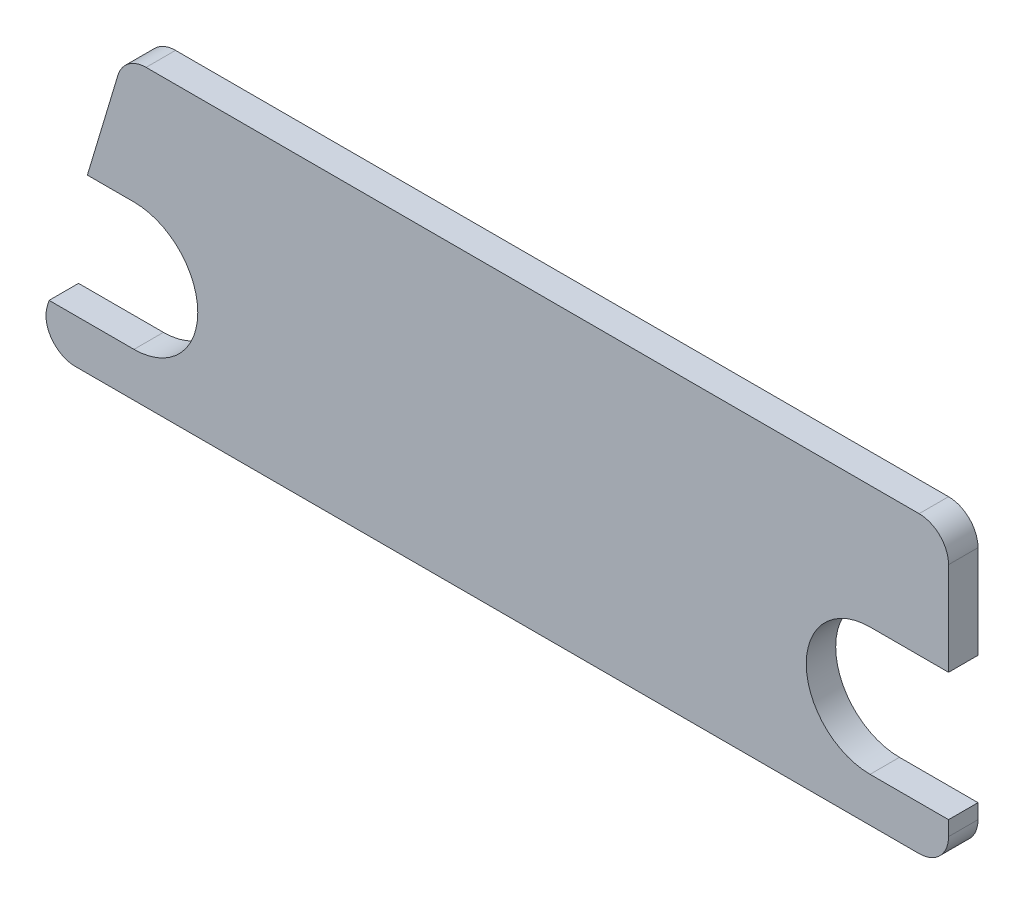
ISO-10303-21;
HEADER;
FILE_DESCRIPTION(('STEP AP214'),'2;1');
FILE_NAME('part.step','',(''),(''),'','','');
FILE_SCHEMA(('AUTOMOTIVE_DESIGN { 1 0 10303 214 1 1 1 1 }'));
ENDSEC;
DATA;
#1=APPLICATION_CONTEXT('core data for automotive mechanical design processes');
#2=APPLICATION_PROTOCOL_DEFINITION('international standard','automotive_design',2000,#1);
#3=PRODUCT_CONTEXT('',#1,'mechanical');
#4=PRODUCT('Part','Part','',(#3));
#5=PRODUCT_RELATED_PRODUCT_CATEGORY('part','',(#4));
#6=PRODUCT_DEFINITION_FORMATION('','',#4);
#7=PRODUCT_DEFINITION_CONTEXT('part definition',#1,'design');
#8=PRODUCT_DEFINITION('design','',#6,#7);
#9=PRODUCT_DEFINITION_SHAPE('','',#8);
#10=(LENGTH_UNIT() NAMED_UNIT(*) SI_UNIT(.MILLI.,.METRE.));
#11=(NAMED_UNIT(*) PLANE_ANGLE_UNIT() SI_UNIT($,.RADIAN.));
#12=(NAMED_UNIT(*) SI_UNIT($,.STERADIAN.) SOLID_ANGLE_UNIT());
#13=UNCERTAINTY_MEASURE_WITH_UNIT(LENGTH_MEASURE(1.E-05),#10,'distance_accuracy_value','');
#14=(GEOMETRIC_REPRESENTATION_CONTEXT(3) GLOBAL_UNCERTAINTY_ASSIGNED_CONTEXT((#13)) GLOBAL_UNIT_ASSIGNED_CONTEXT((#10,
#11,#12)) REPRESENTATION_CONTEXT('',''));
#15=CARTESIAN_POINT('',(0.,0.,0.));
#16=DIRECTION('',(0.,0.,1.));
#17=DIRECTION('',(1.,0.,0.));
#18=AXIS2_PLACEMENT_3D('',#15,#16,#17);
#19=CARTESIAN_POINT('',(-88.9679080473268,2.99999999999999,3.));
#20=DIRECTION('',(0.,0.,-1.));
#21=DIRECTION('',(-1.,0.,0.));
#22=AXIS2_PLACEMENT_3D('',#19,#20,#21);
#23=CYLINDRICAL_SURFACE('',#22,3.00000000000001);
#24=CARTESIAN_POINT('',(-88.9679080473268,2.99999999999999,0.));
#25=DIRECTION('',(0.,0.,1.));
#26=DIRECTION('',(-1.,0.,0.));
#27=AXIS2_PLACEMENT_3D('',#24,#25,#26);
#28=CIRCLE('',#27,3.00000000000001);
#29=CARTESIAN_POINT('',(-91.8413869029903,3.86204365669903,0.));
#30=VERTEX_POINT('',#29);
#31=CARTESIAN_POINT('',(-88.9679080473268,0.,0.));
#32=VERTEX_POINT('',#31);
#33=EDGE_CURVE('E146',#30,#32,#28,.T.);
#34=ORIENTED_EDGE('',*,*,#33,.T.);
#35=DIRECTION('',(0.,0.,-1.));
#36=VECTOR('',#35,1.);
#37=CARTESIAN_POINT('',(-88.9679080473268,0.,3.));
#38=LINE('',#37,#36);
#39=CARTESIAN_POINT('',(-88.9679080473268,0.,3.));
#40=VERTEX_POINT('',#39);
#41=EDGE_CURVE('E11',#40,#32,#38,.T.);
#42=ORIENTED_EDGE('',*,*,#41,.F.);
#43=CARTESIAN_POINT('',(-88.9679080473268,2.99999999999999,3.));
#44=DIRECTION('',(0.,0.,1.));
#45=DIRECTION('',(-1.,0.,0.));
#46=AXIS2_PLACEMENT_3D('',#43,#44,#45);
#47=CIRCLE('',#46,3.00000000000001);
#48=CARTESIAN_POINT('',(-91.8413869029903,3.86204365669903,3.));
#49=VERTEX_POINT('',#48);
#50=EDGE_CURVE('E189',#49,#40,#47,.T.);
#51=ORIENTED_EDGE('',*,*,#50,.F.);
#52=DIRECTION('',(0.,0.,-1.));
#53=VECTOR('',#52,1.);
#54=CARTESIAN_POINT('',(-91.8413869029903,3.86204365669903,3.));
#55=LINE('',#54,#53);
#56=EDGE_CURVE('E159',#49,#30,#55,.T.);
#57=ORIENTED_EDGE('',*,*,#56,.T.);
#58=EDGE_LOOP('',(#34,#42,#51,#57));
#59=FACE_BOUND('',#58,.T.);
#60=ADVANCED_FACE('F30',(#59),#23,.T.);
#61=CARTESIAN_POINT('',(-3.00000000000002,0.,3.));
#62=DIRECTION('',(0.,1.,0.));
#63=DIRECTION('',(-1.,0.,0.));
#64=AXIS2_PLACEMENT_3D('',#61,#62,#63);
#65=PLANE('',#64);
#66=DIRECTION('',(1.,0.,0.));
#67=VECTOR('',#66,1.);
#68=CARTESIAN_POINT('',(-3.00000000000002,0.,0.));
#69=LINE('',#68,#67);
#70=CARTESIAN_POINT('',(-3.00000000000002,0.,0.));
#71=VERTEX_POINT('',#70);
#72=EDGE_CURVE('E142',#32,#71,#69,.T.);
#73=ORIENTED_EDGE('',*,*,#72,.T.);
#74=DIRECTION('',(0.,0.,-1.));
#75=VECTOR('',#74,1.);
#76=CARTESIAN_POINT('',(-3.00000000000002,0.,3.));
#77=LINE('',#76,#75);
#78=CARTESIAN_POINT('',(-3.00000000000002,0.,3.));
#79=VERTEX_POINT('',#78);
#80=EDGE_CURVE('E37',#79,#71,#77,.T.);
#81=ORIENTED_EDGE('',*,*,#80,.F.);
#82=DIRECTION('',(1.,0.,0.));
#83=VECTOR('',#82,1.);
#84=CARTESIAN_POINT('',(-3.00000000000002,0.,3.));
#85=LINE('',#84,#83);
#86=EDGE_CURVE('E155',#40,#79,#85,.T.);
#87=ORIENTED_EDGE('',*,*,#86,.F.);
#88=ORIENTED_EDGE('',*,*,#41,.T.);
#89=EDGE_LOOP('',(#73,#81,#87,#88));
#90=FACE_BOUND('',#89,.T.);
#91=ADVANCED_FACE('F154',(#90),#65,.F.);
#92=CARTESIAN_POINT('',(-3.,3.,3.));
#93=DIRECTION('',(0.,0.,-1.));
#94=DIRECTION('',(-1.,0.,0.));
#95=AXIS2_PLACEMENT_3D('',#92,#93,#94);
#96=CYLINDRICAL_SURFACE('',#95,3.);
#97=CARTESIAN_POINT('',(-3.,3.,0.));
#98=DIRECTION('',(0.,0.,1.));
#99=DIRECTION('',(-1.,0.,0.));
#100=AXIS2_PLACEMENT_3D('',#97,#98,#99);
#101=CIRCLE('',#100,3.);
#102=CARTESIAN_POINT('',(0.,3.00000000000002,0.));
#103=VERTEX_POINT('',#102);
#104=EDGE_CURVE('E148',#71,#103,#101,.T.);
#105=ORIENTED_EDGE('',*,*,#104,.T.);
#106=DIRECTION('',(0.,0.,-1.));
#107=VECTOR('',#106,1.);
#108=CARTESIAN_POINT('',(0.,3.00000000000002,3.));
#109=LINE('',#108,#107);
#110=CARTESIAN_POINT('',(0.,3.00000000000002,3.));
#111=VERTEX_POINT('',#110);
#112=EDGE_CURVE('E255',#111,#103,#109,.T.);
#113=ORIENTED_EDGE('',*,*,#112,.F.);
#114=CARTESIAN_POINT('',(-3.,3.,3.));
#115=DIRECTION('',(0.,0.,1.));
#116=DIRECTION('',(-1.,0.,0.));
#117=AXIS2_PLACEMENT_3D('',#114,#115,#116);
#118=CIRCLE('',#117,3.);
#119=EDGE_CURVE('E192',#79,#111,#118,.T.);
#120=ORIENTED_EDGE('',*,*,#119,.F.);
#121=ORIENTED_EDGE('',*,*,#80,.T.);
#122=EDGE_LOOP('',(#105,#113,#120,#121));
#123=FACE_BOUND('',#122,.T.);
#124=ADVANCED_FACE('F259',(#123),#96,.T.);
#125=CARTESIAN_POINT('',(0.,3.00000000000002,3.));
#126=DIRECTION('',(-1.,0.,0.));
#127=DIRECTION('',(0.,0.,1.));
#128=AXIS2_PLACEMENT_3D('',#125,#126,#127);
#129=PLANE('',#128);
#130=DIRECTION('',(0.,1.,0.));
#131=VECTOR('',#130,1.);
#132=CARTESIAN_POINT('',(0.,3.00000000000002,0.));
#133=LINE('',#132,#131);
#134=CARTESIAN_POINT('',(0.,4.5,0.));
#135=VERTEX_POINT('',#134);
#136=EDGE_CURVE('E163',#103,#135,#133,.T.);
#137=ORIENTED_EDGE('',*,*,#136,.T.);
#138=DIRECTION('',(0.,0.,-1.));
#139=VECTOR('',#138,1.);
#140=CARTESIAN_POINT('',(0.,4.5,3.));
#141=LINE('',#140,#139);
#142=CARTESIAN_POINT('',(0.,4.5,3.));
#143=VERTEX_POINT('',#142);
#144=EDGE_CURVE('E252',#143,#135,#141,.T.);
#145=ORIENTED_EDGE('',*,*,#144,.F.);
#146=DIRECTION('',(0.,1.,0.));
#147=VECTOR('',#146,1.);
#148=CARTESIAN_POINT('',(0.,3.00000000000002,3.));
#149=LINE('',#148,#147);
#150=EDGE_CURVE('E194',#111,#143,#149,.T.);
#151=ORIENTED_EDGE('',*,*,#150,.F.);
#152=ORIENTED_EDGE('',*,*,#112,.T.);
#153=EDGE_LOOP('',(#137,#145,#151,#152));
#154=FACE_BOUND('',#153,.T.);
#155=ADVANCED_FACE('F267',(#154),#129,.F.);
#156=CARTESIAN_POINT('',(-7.99999999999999,4.5,3.));
#157=DIRECTION('',(0.,-1.,0.));
#158=DIRECTION('',(1.,0.,0.));
#159=AXIS2_PLACEMENT_3D('',#156,#157,#158);
#160=PLANE('',#159);
#161=DIRECTION('',(-1.,0.,0.));
#162=VECTOR('',#161,1.);
#163=CARTESIAN_POINT('',(-7.99999999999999,4.5,0.));
#164=LINE('',#163,#162);
#165=CARTESIAN_POINT('',(-7.99999999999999,4.5,0.));
#166=VERTEX_POINT('',#165);
#167=EDGE_CURVE('E165',#135,#166,#164,.T.);
#168=ORIENTED_EDGE('',*,*,#167,.T.);
#169=DIRECTION('',(0.,0.,-1.));
#170=VECTOR('',#169,1.);
#171=CARTESIAN_POINT('',(-7.99999999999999,4.5,3.));
#172=LINE('',#171,#170);
#173=CARTESIAN_POINT('',(-7.99999999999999,4.5,3.));
#174=VERTEX_POINT('',#173);
#175=EDGE_CURVE('E249',#174,#166,#172,.T.);
#176=ORIENTED_EDGE('',*,*,#175,.F.);
#177=DIRECTION('',(-1.,0.,0.));
#178=VECTOR('',#177,1.);
#179=CARTESIAN_POINT('',(-7.99999999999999,4.5,3.));
#180=LINE('',#179,#178);
#181=EDGE_CURVE('E196',#143,#174,#180,.T.);
#182=ORIENTED_EDGE('',*,*,#181,.F.);
#183=ORIENTED_EDGE('',*,*,#144,.T.);
#184=EDGE_LOOP('',(#168,#176,#182,#183));
#185=FACE_BOUND('',#184,.T.);
#186=ADVANCED_FACE('F270',(#185),#160,.F.);
#187=CARTESIAN_POINT('',(-7.99999999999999,11.,3.));
#188=DIRECTION('',(0.,0.,-1.));
#189=DIRECTION('',(-1.,0.,0.));
#190=AXIS2_PLACEMENT_3D('',#187,#188,#189);
#191=CYLINDRICAL_SURFACE('',#190,6.5);
#192=CARTESIAN_POINT('',(-7.99999999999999,11.,0.));
#193=DIRECTION('',(0.,0.,-1.));
#194=DIRECTION('',(1.,0.,0.));
#195=AXIS2_PLACEMENT_3D('',#192,#193,#194);
#196=CIRCLE('',#195,6.5);
#197=CARTESIAN_POINT('',(-7.99999999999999,17.5,0.));
#198=VERTEX_POINT('',#197);
#199=EDGE_CURVE('E167',#166,#198,#196,.T.);
#200=ORIENTED_EDGE('',*,*,#199,.T.);
#201=DIRECTION('',(0.,0.,-1.));
#202=VECTOR('',#201,1.);
#203=CARTESIAN_POINT('',(-7.99999999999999,17.5,3.));
#204=LINE('',#203,#202);
#205=CARTESIAN_POINT('',(-7.99999999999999,17.5,3.));
#206=VERTEX_POINT('',#205);
#207=EDGE_CURVE('E246',#206,#198,#204,.T.);
#208=ORIENTED_EDGE('',*,*,#207,.F.);
#209=CARTESIAN_POINT('',(-7.99999999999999,11.,3.));
#210=DIRECTION('',(0.,0.,-1.));
#211=DIRECTION('',(1.,0.,0.));
#212=AXIS2_PLACEMENT_3D('',#209,#210,#211);
#213=CIRCLE('',#212,6.5);
#214=EDGE_CURVE('E198',#174,#206,#213,.T.);
#215=ORIENTED_EDGE('',*,*,#214,.F.);
#216=ORIENTED_EDGE('',*,*,#175,.T.);
#217=EDGE_LOOP('',(#200,#208,#215,#216));
#218=FACE_BOUND('',#217,.T.);
#219=ADVANCED_FACE('F275',(#218),#191,.F.);
#220=CARTESIAN_POINT('',(-7.99999999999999,17.5,3.));
#221=DIRECTION('',(0.,1.,0.));
#222=DIRECTION('',(0.,0.,1.));
#223=AXIS2_PLACEMENT_3D('',#220,#221,#222);
#224=PLANE('',#223);
#225=DIRECTION('',(1.,0.,0.));
#226=VECTOR('',#225,1.);
#227=CARTESIAN_POINT('',(-7.99999999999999,17.5,0.));
#228=LINE('',#227,#226);
#229=CARTESIAN_POINT('',(0.,17.5,0.));
#230=VERTEX_POINT('',#229);
#231=EDGE_CURVE('E169',#198,#230,#228,.T.);
#232=ORIENTED_EDGE('',*,*,#231,.T.);
#233=DIRECTION('',(0.,0.,-1.));
#234=VECTOR('',#233,1.);
#235=CARTESIAN_POINT('',(0.,17.5,3.));
#236=LINE('',#235,#234);
#237=CARTESIAN_POINT('',(0.,17.5,3.));
#238=VERTEX_POINT('',#237);
#239=EDGE_CURVE('E243',#238,#230,#236,.T.);
#240=ORIENTED_EDGE('',*,*,#239,.F.);
#241=DIRECTION('',(1.,0.,0.));
#242=VECTOR('',#241,1.);
#243=CARTESIAN_POINT('',(-7.99999999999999,17.5,3.));
#244=LINE('',#243,#242);
#245=EDGE_CURVE('E200',#206,#238,#244,.T.);
#246=ORIENTED_EDGE('',*,*,#245,.F.);
#247=ORIENTED_EDGE('',*,*,#207,.T.);
#248=EDGE_LOOP('',(#232,#240,#246,#247));
#249=FACE_BOUND('',#248,.T.);
#250=ADVANCED_FACE('F281',(#249),#224,.F.);
#251=CARTESIAN_POINT('',(0.,17.5,3.));
#252=DIRECTION('',(-1.,0.,0.));
#253=DIRECTION('',(0.,0.,1.));
#254=AXIS2_PLACEMENT_3D('',#251,#252,#253);
#255=PLANE('',#254);
#256=DIRECTION('',(0.,1.,0.));
#257=VECTOR('',#256,1.);
#258=CARTESIAN_POINT('',(0.,17.5,0.));
#259=LINE('',#258,#257);
#260=CARTESIAN_POINT('',(0.,27.,0.));
#261=VERTEX_POINT('',#260);
#262=EDGE_CURVE('E171',#230,#261,#259,.T.);
#263=ORIENTED_EDGE('',*,*,#262,.T.);
#264=DIRECTION('',(0.,0.,-1.));
#265=VECTOR('',#264,1.);
#266=CARTESIAN_POINT('',(0.,27.,3.));
#267=LINE('',#266,#265);
#268=CARTESIAN_POINT('',(0.,27.,3.));
#269=VERTEX_POINT('',#268);
#270=EDGE_CURVE('E240',#269,#261,#267,.T.);
#271=ORIENTED_EDGE('',*,*,#270,.F.);
#272=DIRECTION('',(0.,1.,0.));
#273=VECTOR('',#272,1.);
#274=CARTESIAN_POINT('',(0.,17.5,3.));
#275=LINE('',#274,#273);
#276=EDGE_CURVE('E202',#238,#269,#275,.T.);
#277=ORIENTED_EDGE('',*,*,#276,.F.);
#278=ORIENTED_EDGE('',*,*,#239,.T.);
#279=EDGE_LOOP('',(#263,#271,#277,#278));
#280=FACE_BOUND('',#279,.T.);
#281=ADVANCED_FACE('F285',(#280),#255,.F.);
#282=CARTESIAN_POINT('',(-3.,27.,3.));
#283=DIRECTION('',(0.,0.,-1.));
#284=DIRECTION('',(-1.,0.,0.));
#285=AXIS2_PLACEMENT_3D('',#282,#283,#284);
#286=CYLINDRICAL_SURFACE('',#285,3.);
#287=CARTESIAN_POINT('',(-3.,27.,0.));
#288=DIRECTION('',(0.,0.,1.));
#289=DIRECTION('',(1.,0.,0.));
#290=AXIS2_PLACEMENT_3D('',#287,#288,#289);
#291=CIRCLE('',#290,3.);
#292=CARTESIAN_POINT('',(-3.00000000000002,30.,0.));
#293=VERTEX_POINT('',#292);
#294=EDGE_CURVE('E173',#261,#293,#291,.T.);
#295=ORIENTED_EDGE('',*,*,#294,.T.);
#296=DIRECTION('',(0.,0.,-1.));
#297=VECTOR('',#296,1.);
#298=CARTESIAN_POINT('',(-3.00000000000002,30.,3.));
#299=LINE('',#298,#297);
#300=CARTESIAN_POINT('',(-3.00000000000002,30.,3.));
#301=VERTEX_POINT('',#300);
#302=EDGE_CURVE('E237',#301,#293,#299,.T.);
#303=ORIENTED_EDGE('',*,*,#302,.F.);
#304=CARTESIAN_POINT('',(-3.,27.,3.));
#305=DIRECTION('',(0.,0.,1.));
#306=DIRECTION('',(1.,0.,0.));
#307=AXIS2_PLACEMENT_3D('',#304,#305,#306);
#308=CIRCLE('',#307,3.);
#309=EDGE_CURVE('E204',#269,#301,#308,.T.);
#310=ORIENTED_EDGE('',*,*,#309,.F.);
#311=ORIENTED_EDGE('',*,*,#270,.T.);
#312=EDGE_LOOP('',(#295,#303,#310,#311));
#313=FACE_BOUND('',#312,.T.);
#314=ADVANCED_FACE('F290',(#313),#286,.T.);
#315=CARTESIAN_POINT('',(-3.00000000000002,30.,3.));
#316=DIRECTION('',(0.,-1.,0.));
#317=DIRECTION('',(1.,0.,0.));
#318=AXIS2_PLACEMENT_3D('',#315,#316,#317);
#319=PLANE('',#318);
#320=DIRECTION('',(-1.,0.,0.));
#321=VECTOR('',#320,1.);
#322=CARTESIAN_POINT('',(-3.00000000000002,30.,0.));
#323=LINE('',#322,#321);
#324=CARTESIAN_POINT('',(-81.7679080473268,30.,0.));
#325=VERTEX_POINT('',#324);
#326=EDGE_CURVE('E175',#293,#325,#323,.T.);
#327=ORIENTED_EDGE('',*,*,#326,.T.);
#328=DIRECTION('',(0.,0.,-1.));
#329=VECTOR('',#328,1.);
#330=CARTESIAN_POINT('',(-81.7679080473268,30.,3.));
#331=LINE('',#330,#329);
#332=CARTESIAN_POINT('',(-81.7679080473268,30.,3.));
#333=VERTEX_POINT('',#332);
#334=EDGE_CURVE('E234',#333,#325,#331,.T.);
#335=ORIENTED_EDGE('',*,*,#334,.F.);
#336=DIRECTION('',(-1.,0.,0.));
#337=VECTOR('',#336,1.);
#338=CARTESIAN_POINT('',(-3.00000000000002,30.,3.));
#339=LINE('',#338,#337);
#340=EDGE_CURVE('E206',#301,#333,#339,.T.);
#341=ORIENTED_EDGE('',*,*,#340,.F.);
#342=ORIENTED_EDGE('',*,*,#302,.T.);
#343=EDGE_LOOP('',(#327,#335,#341,#342));
#344=FACE_BOUND('',#343,.T.);
#345=ADVANCED_FACE('F296',(#344),#319,.F.);
#346=CARTESIAN_POINT('',(-81.7679080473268,27.,3.));
#347=DIRECTION('',(0.,0.,-1.));
#348=DIRECTION('',(-1.,0.,0.));
#349=AXIS2_PLACEMENT_3D('',#346,#347,#348);
#350=CYLINDRICAL_SURFACE('',#349,2.99999999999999);
#351=CARTESIAN_POINT('',(-81.7679080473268,27.,0.));
#352=DIRECTION('',(0.,0.,1.));
#353=DIRECTION('',(1.,0.,0.));
#354=AXIS2_PLACEMENT_3D('',#351,#352,#353);
#355=CIRCLE('',#354,2.99999999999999);
#356=CARTESIAN_POINT('',(-84.6413869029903,27.862043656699,0.));
#357=VERTEX_POINT('',#356);
#358=EDGE_CURVE('E177',#325,#357,#355,.T.);
#359=ORIENTED_EDGE('',*,*,#358,.T.);
#360=DIRECTION('',(0.,0.,-1.));
#361=VECTOR('',#360,1.);
#362=CARTESIAN_POINT('',(-84.6413869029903,27.862043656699,3.));
#363=LINE('',#362,#361);
#364=CARTESIAN_POINT('',(-84.6413869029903,27.862043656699,3.));
#365=VERTEX_POINT('',#364);
#366=EDGE_CURVE('E231',#365,#357,#363,.T.);
#367=ORIENTED_EDGE('',*,*,#366,.F.);
#368=CARTESIAN_POINT('',(-81.7679080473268,27.,3.));
#369=DIRECTION('',(0.,0.,1.));
#370=DIRECTION('',(1.,0.,0.));
#371=AXIS2_PLACEMENT_3D('',#368,#369,#370);
#372=CIRCLE('',#371,2.99999999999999);
#373=EDGE_CURVE('E208',#333,#365,#372,.T.);
#374=ORIENTED_EDGE('',*,*,#373,.F.);
#375=ORIENTED_EDGE('',*,*,#334,.T.);
#376=EDGE_LOOP('',(#359,#367,#374,#375));
#377=FACE_BOUND('',#376,.T.);
#378=ADVANCED_FACE('F300',(#377),#350,.T.);
#379=CARTESIAN_POINT('',(-84.6413869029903,27.862043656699,3.));
#380=DIRECTION('',(0.957826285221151,-0.287347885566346,0.));
#381=DIRECTION('',(0.287347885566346,0.957826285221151,0.));
#382=AXIS2_PLACEMENT_3D('',#379,#380,#381);
#383=PLANE('',#382);
#384=DIRECTION('',(-0.287347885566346,-0.957826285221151,0.));
#385=VECTOR('',#384,1.);
#386=CARTESIAN_POINT('',(-84.6413869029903,27.862043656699,0.));
#387=LINE('',#386,#385);
#388=CARTESIAN_POINT('',(-87.75,17.5,0.));
#389=VERTEX_POINT('',#388);
#390=EDGE_CURVE('E179',#357,#389,#387,.T.);
#391=ORIENTED_EDGE('',*,*,#390,.T.);
#392=DIRECTION('',(0.,0.,-1.));
#393=VECTOR('',#392,1.);
#394=CARTESIAN_POINT('',(-87.75,17.5,3.));
#395=LINE('',#394,#393);
#396=CARTESIAN_POINT('',(-87.75,17.5,3.));
#397=VERTEX_POINT('',#396);
#398=EDGE_CURVE('E228',#397,#389,#395,.T.);
#399=ORIENTED_EDGE('',*,*,#398,.F.);
#400=DIRECTION('',(-0.287347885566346,-0.957826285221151,0.));
#401=VECTOR('',#400,1.);
#402=CARTESIAN_POINT('',(-84.6413869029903,27.862043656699,3.));
#403=LINE('',#402,#401);
#404=EDGE_CURVE('E210',#365,#397,#403,.T.);
#405=ORIENTED_EDGE('',*,*,#404,.F.);
#406=ORIENTED_EDGE('',*,*,#366,.T.);
#407=EDGE_LOOP('',(#391,#399,#405,#406));
#408=FACE_BOUND('',#407,.T.);
#409=ADVANCED_FACE('F305',(#408),#383,.F.);
#410=CARTESIAN_POINT('',(-83.,17.5,3.));
#411=DIRECTION('',(0.,1.,0.));
#412=DIRECTION('',(-1.,0.,0.));
#413=AXIS2_PLACEMENT_3D('',#410,#411,#412);
#414=PLANE('',#413);
#415=DIRECTION('',(1.,0.,0.));
#416=VECTOR('',#415,1.);
#417=CARTESIAN_POINT('',(-83.,17.5,0.));
#418=LINE('',#417,#416);
#419=CARTESIAN_POINT('',(-83.,17.5,0.));
#420=VERTEX_POINT('',#419);
#421=EDGE_CURVE('E181',#389,#420,#418,.T.);
#422=ORIENTED_EDGE('',*,*,#421,.T.);
#423=DIRECTION('',(0.,0.,-1.));
#424=VECTOR('',#423,1.);
#425=CARTESIAN_POINT('',(-83.,17.5,3.));
#426=LINE('',#425,#424);
#427=CARTESIAN_POINT('',(-83.,17.5,3.));
#428=VERTEX_POINT('',#427);
#429=EDGE_CURVE('E225',#428,#420,#426,.T.);
#430=ORIENTED_EDGE('',*,*,#429,.F.);
#431=DIRECTION('',(1.,0.,0.));
#432=VECTOR('',#431,1.);
#433=CARTESIAN_POINT('',(-83.,17.5,3.));
#434=LINE('',#433,#432);
#435=EDGE_CURVE('E212',#397,#428,#434,.T.);
#436=ORIENTED_EDGE('',*,*,#435,.F.);
#437=ORIENTED_EDGE('',*,*,#398,.T.);
#438=EDGE_LOOP('',(#422,#430,#436,#437));
#439=FACE_BOUND('',#438,.T.);
#440=ADVANCED_FACE('F311',(#439),#414,.F.);
#441=CARTESIAN_POINT('',(-83.,11.,3.));
#442=DIRECTION('',(0.,0.,-1.));
#443=DIRECTION('',(-1.,0.,0.));
#444=AXIS2_PLACEMENT_3D('',#441,#442,#443);
#445=CYLINDRICAL_SURFACE('',#444,6.5);
#446=CARTESIAN_POINT('',(-83.,11.,0.));
#447=DIRECTION('',(0.,0.,-1.));
#448=DIRECTION('',(1.,0.,0.));
#449=AXIS2_PLACEMENT_3D('',#446,#447,#448);
#450=CIRCLE('',#449,6.5);
#451=CARTESIAN_POINT('',(-83.,4.5,0.));
#452=VERTEX_POINT('',#451);
#453=EDGE_CURVE('E183',#420,#452,#450,.T.);
#454=ORIENTED_EDGE('',*,*,#453,.T.);
#455=DIRECTION('',(0.,0.,-1.));
#456=VECTOR('',#455,1.);
#457=CARTESIAN_POINT('',(-83.,4.5,3.));
#458=LINE('',#457,#456);
#459=CARTESIAN_POINT('',(-83.,4.5,3.));
#460=VERTEX_POINT('',#459);
#461=EDGE_CURVE('E222',#460,#452,#458,.T.);
#462=ORIENTED_EDGE('',*,*,#461,.F.);
#463=CARTESIAN_POINT('',(-83.,11.,3.));
#464=DIRECTION('',(0.,0.,-1.));
#465=DIRECTION('',(1.,0.,0.));
#466=AXIS2_PLACEMENT_3D('',#463,#464,#465);
#467=CIRCLE('',#466,6.5);
#468=EDGE_CURVE('E214',#428,#460,#467,.T.);
#469=ORIENTED_EDGE('',*,*,#468,.F.);
#470=ORIENTED_EDGE('',*,*,#429,.T.);
#471=EDGE_LOOP('',(#454,#462,#469,#470));
#472=FACE_BOUND('',#471,.T.);
#473=ADVANCED_FACE('F315',(#472),#445,.F.);
#474=CARTESIAN_POINT('',(-83.,4.5,3.));
#475=DIRECTION('',(0.,-1.,0.));
#476=DIRECTION('',(1.,0.,0.));
#477=AXIS2_PLACEMENT_3D('',#474,#475,#476);
#478=PLANE('',#477);
#479=DIRECTION('',(-1.,0.,0.));
#480=VECTOR('',#479,1.);
#481=CARTESIAN_POINT('',(-83.,4.5,0.));
#482=LINE('',#481,#480);
#483=CARTESIAN_POINT('',(-91.65,4.49999999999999,0.));
#484=VERTEX_POINT('',#483);
#485=EDGE_CURVE('E185',#452,#484,#482,.T.);
#486=ORIENTED_EDGE('',*,*,#485,.T.);
#487=DIRECTION('',(0.,0.,-1.));
#488=VECTOR('',#487,1.);
#489=CARTESIAN_POINT('',(-91.65,4.49999999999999,3.));
#490=LINE('',#489,#488);
#491=CARTESIAN_POINT('',(-91.65,4.49999999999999,3.));
#492=VERTEX_POINT('',#491);
#493=EDGE_CURVE('E219',#492,#484,#490,.T.);
#494=ORIENTED_EDGE('',*,*,#493,.F.);
#495=DIRECTION('',(-1.,0.,0.));
#496=VECTOR('',#495,1.);
#497=CARTESIAN_POINT('',(-83.,4.5,3.));
#498=LINE('',#497,#496);
#499=EDGE_CURVE('E49',#460,#492,#498,.T.);
#500=ORIENTED_EDGE('',*,*,#499,.F.);
#501=ORIENTED_EDGE('',*,*,#461,.T.);
#502=EDGE_LOOP('',(#486,#494,#500,#501));
#503=FACE_BOUND('',#502,.T.);
#504=ADVANCED_FACE('F318',(#503),#478,.F.);
#505=CARTESIAN_POINT('',(-91.65,4.49999999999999,3.));
#506=DIRECTION('',(0.957826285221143,-0.287347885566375,0.));
#507=DIRECTION('',(0.287347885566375,0.957826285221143,0.));
#508=AXIS2_PLACEMENT_3D('',#505,#506,#507);
#509=PLANE('',#508);
#510=DIRECTION('',(-0.287347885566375,-0.957826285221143,0.));
#511=VECTOR('',#510,1.);
#512=CARTESIAN_POINT('',(-91.65,4.49999999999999,0.));
#513=LINE('',#512,#511);
#514=EDGE_CURVE('E187',#484,#30,#513,.T.);
#515=ORIENTED_EDGE('',*,*,#514,.T.);
#516=ORIENTED_EDGE('',*,*,#56,.F.);
#517=DIRECTION('',(-0.287347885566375,-0.957826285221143,0.));
#518=VECTOR('',#517,1.);
#519=CARTESIAN_POINT('',(-91.65,4.49999999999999,3.));
#520=LINE('',#519,#518);
#521=EDGE_CURVE('E44',#492,#49,#520,.T.);
#522=ORIENTED_EDGE('',*,*,#521,.F.);
#523=ORIENTED_EDGE('',*,*,#493,.T.);
#524=EDGE_LOOP('',(#515,#516,#522,#523));
#525=FACE_BOUND('',#524,.T.);
#526=ADVANCED_FACE('F320',(#525),#509,.F.);
#527=CARTESIAN_POINT('',(-88.9679080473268,2.99999999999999,3.));
#528=DIRECTION('',(0.,0.,-1.));
#529=DIRECTION('',(-1.,0.,0.));
#530=AXIS2_PLACEMENT_3D('',#527,#528,#529);
#531=PLANE('',#530);
#532=ORIENTED_EDGE('',*,*,#50,.T.);
#533=ORIENTED_EDGE('',*,*,#86,.T.);
#534=ORIENTED_EDGE('',*,*,#119,.T.);
#535=ORIENTED_EDGE('',*,*,#150,.T.);
#536=ORIENTED_EDGE('',*,*,#181,.T.);
#537=ORIENTED_EDGE('',*,*,#214,.T.);
#538=ORIENTED_EDGE('',*,*,#245,.T.);
#539=ORIENTED_EDGE('',*,*,#276,.T.);
#540=ORIENTED_EDGE('',*,*,#309,.T.);
#541=ORIENTED_EDGE('',*,*,#340,.T.);
#542=ORIENTED_EDGE('',*,*,#373,.T.);
#543=ORIENTED_EDGE('',*,*,#404,.T.);
#544=ORIENTED_EDGE('',*,*,#435,.T.);
#545=ORIENTED_EDGE('',*,*,#468,.T.);
#546=ORIENTED_EDGE('',*,*,#499,.T.);
#547=ORIENTED_EDGE('',*,*,#521,.T.);
#548=EDGE_LOOP('',(#532,#533,#534,#535,#536,#537,#538,#539,#540,#541,#542,#543,#544,#545,#546,#547));
#549=FACE_BOUND('',#548,.T.);
#550=ADVANCED_FACE('F262',(#549),#531,.F.);
#551=CARTESIAN_POINT('',(-88.9679080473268,2.99999999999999,0.));
#552=DIRECTION('',(0.,0.,-1.));
#553=DIRECTION('',(-1.,0.,0.));
#554=AXIS2_PLACEMENT_3D('',#551,#552,#553);
#555=PLANE('',#554);
#556=ORIENTED_EDGE('',*,*,#33,.F.);
#557=ORIENTED_EDGE('',*,*,#514,.F.);
#558=ORIENTED_EDGE('',*,*,#485,.F.);
#559=ORIENTED_EDGE('',*,*,#453,.F.);
#560=ORIENTED_EDGE('',*,*,#421,.F.);
#561=ORIENTED_EDGE('',*,*,#390,.F.);
#562=ORIENTED_EDGE('',*,*,#358,.F.);
#563=ORIENTED_EDGE('',*,*,#326,.F.);
#564=ORIENTED_EDGE('',*,*,#294,.F.);
#565=ORIENTED_EDGE('',*,*,#262,.F.);
#566=ORIENTED_EDGE('',*,*,#231,.F.);
#567=ORIENTED_EDGE('',*,*,#199,.F.);
#568=ORIENTED_EDGE('',*,*,#167,.F.);
#569=ORIENTED_EDGE('',*,*,#136,.F.);
#570=ORIENTED_EDGE('',*,*,#104,.F.);
#571=ORIENTED_EDGE('',*,*,#72,.F.);
#572=EDGE_LOOP('',(#556,#557,#558,#559,#560,#561,#562,#563,#564,#565,#566,#567,#568,#569,#570,#571));
#573=FACE_BOUND('',#572,.T.);
#574=ADVANCED_FACE('F143',(#573),#555,.T.);
#575=CLOSED_SHELL('',(#60,#91,#124,#155,#186,#219,#250,#281,#314,#345,#378,#409,#440,#473,#504,
#526,#550,#574));
#576=MANIFOLD_SOLID_BREP('B2',#575);
#577=ADVANCED_BREP_SHAPE_REPRESENTATION('',(#18,#576),#14);
#578=SHAPE_DEFINITION_REPRESENTATION(#9,#577);
ENDSEC;
END-ISO-10303-21;
